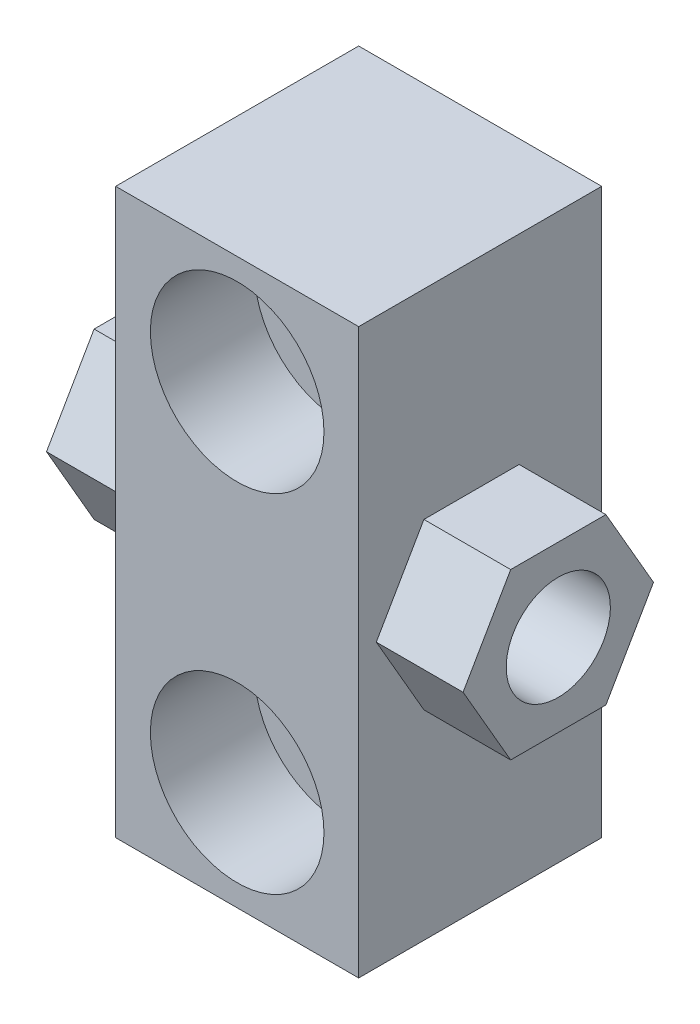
ISO-10303-21;
HEADER;
FILE_DESCRIPTION(('STEP AP214'),'2;1');
FILE_NAME('part.step','',(''),(''),'','','');
FILE_SCHEMA(('AUTOMOTIVE_DESIGN { 1 0 10303 214 1 1 1 1 }'));
ENDSEC;
DATA;
#1=APPLICATION_CONTEXT('core data for automotive mechanical design processes');
#2=APPLICATION_PROTOCOL_DEFINITION('international standard','automotive_design',2000,#1);
#3=PRODUCT_CONTEXT('',#1,'mechanical');
#4=PRODUCT('Part','Part','',(#3));
#5=PRODUCT_RELATED_PRODUCT_CATEGORY('part','',(#4));
#6=PRODUCT_DEFINITION_FORMATION('','',#4);
#7=PRODUCT_DEFINITION_CONTEXT('part definition',#1,'design');
#8=PRODUCT_DEFINITION('design','',#6,#7);
#9=PRODUCT_DEFINITION_SHAPE('','',#8);
#10=(LENGTH_UNIT() NAMED_UNIT(*) SI_UNIT(.MILLI.,.METRE.));
#11=(NAMED_UNIT(*) PLANE_ANGLE_UNIT() SI_UNIT($,.RADIAN.));
#12=(NAMED_UNIT(*) SI_UNIT($,.STERADIAN.) SOLID_ANGLE_UNIT());
#13=UNCERTAINTY_MEASURE_WITH_UNIT(LENGTH_MEASURE(1.E-05),#10,'distance_accuracy_value','');
#14=(GEOMETRIC_REPRESENTATION_CONTEXT(3) GLOBAL_UNCERTAINTY_ASSIGNED_CONTEXT((#13)) GLOBAL_UNIT_ASSIGNED_CONTEXT((#10,
#11,#12)) REPRESENTATION_CONTEXT('',''));
#15=CARTESIAN_POINT('',(0.,0.,0.));
#16=DIRECTION('',(0.,0.,1.));
#17=DIRECTION('',(1.,0.,0.));
#18=AXIS2_PLACEMENT_3D('',#15,#16,#17);
#19=CARTESIAN_POINT('',(0.,0.,29.));
#20=DIRECTION('',(0.,0.,1.));
#21=DIRECTION('',(1.,0.,0.));
#22=AXIS2_PLACEMENT_3D('',#19,#20,#21);
#23=CYLINDRICAL_SURFACE('',#22,6.5);
#24=CARTESIAN_POINT('',(0.,0.,0.));
#25=DIRECTION('',(0.,0.,-1.));
#26=DIRECTION('',(-1.,0.,0.));
#27=AXIS2_PLACEMENT_3D('',#24,#25,#26);
#28=CIRCLE('',#27,6.5);
#29=CARTESIAN_POINT('',(-6.5,0.,0.));
#30=VERTEX_POINT('',#29);
#31=EDGE_CURVE('E288',#30,#30,#28,.T.);
#32=ORIENTED_EDGE('',*,*,#31,.T.);
#33=EDGE_LOOP('',(#32));
#34=FACE_BOUND('',#33,.T.);
#35=CARTESIAN_POINT('',(0.,0.,16.));
#36=DIRECTION('',(0.,0.,1.));
#37=DIRECTION('',(1.,0.,0.));
#38=AXIS2_PLACEMENT_3D('',#35,#36,#37);
#39=CIRCLE('',#38,6.5);
#40=CARTESIAN_POINT('',(6.5,0.,16.));
#41=VERTEX_POINT('',#40);
#42=EDGE_CURVE('E18',#41,#41,#39,.T.);
#43=ORIENTED_EDGE('',*,*,#42,.T.);
#44=EDGE_LOOP('',(#43));
#45=FACE_BOUND('',#44,.T.);
#46=ADVANCED_FACE('F14',(#34,#45),#23,.F.);
#47=CARTESIAN_POINT('',(0.,40.,29.));
#48=DIRECTION('',(0.,0.,1.));
#49=DIRECTION('',(1.,0.,0.));
#50=AXIS2_PLACEMENT_3D('',#47,#48,#49);
#51=CYLINDRICAL_SURFACE('',#50,6.5);
#52=CARTESIAN_POINT('',(0.,40.,0.));
#53=DIRECTION('',(0.,0.,-1.));
#54=DIRECTION('',(-1.,0.,0.));
#55=AXIS2_PLACEMENT_3D('',#52,#53,#54);
#56=CIRCLE('',#55,6.5);
#57=CARTESIAN_POINT('',(-6.5,40.,0.));
#58=VERTEX_POINT('',#57);
#59=EDGE_CURVE('E285',#58,#58,#56,.T.);
#60=ORIENTED_EDGE('',*,*,#59,.T.);
#61=EDGE_LOOP('',(#60));
#62=FACE_BOUND('',#61,.T.);
#63=CARTESIAN_POINT('',(0.,40.,16.));
#64=DIRECTION('',(0.,0.,1.));
#65=DIRECTION('',(1.,0.,0.));
#66=AXIS2_PLACEMENT_3D('',#63,#64,#65);
#67=CIRCLE('',#66,6.5);
#68=CARTESIAN_POINT('',(6.5,40.,16.));
#69=VERTEX_POINT('',#68);
#70=EDGE_CURVE('E267',#69,#69,#67,.T.);
#71=ORIENTED_EDGE('',*,*,#70,.T.);
#72=EDGE_LOOP('',(#71));
#73=FACE_BOUND('',#72,.T.);
#74=ADVANCED_FACE('F310',(#62,#73),#51,.F.);
#75=CARTESIAN_POINT('',(-14.,-12.5,1.));
#76=DIRECTION('',(1.,0.,0.));
#77=DIRECTION('',(0.,1.,0.));
#78=AXIS2_PLACEMENT_3D('',#75,#76,#77);
#79=PLANE('',#78);
#80=DIRECTION('',(0.,0.866025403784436,0.5));
#81=VECTOR('',#80,1.);
#82=CARTESIAN_POINT('',(-14.,10.5,20.4848275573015));
#83=LINE('',#82,#81);
#84=CARTESIAN_POINT('',(-14.,10.5,20.4848275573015));
#85=VERTEX_POINT('',#84);
#86=CARTESIAN_POINT('',(-14.,20.,25.9696551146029));
#87=VERTEX_POINT('',#86);
#88=EDGE_CURVE('E39',#85,#87,#83,.T.);
#89=ORIENTED_EDGE('',*,*,#88,.F.);
#90=DIRECTION('',(0.,0.,-1.));
#91=VECTOR('',#90,1.);
#92=CARTESIAN_POINT('',(-14.,10.5,20.4848275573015));
#93=LINE('',#92,#91);
#94=CARTESIAN_POINT('',(-14.,10.5,9.5151724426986));
#95=VERTEX_POINT('',#94);
#96=EDGE_CURVE('E163',#85,#95,#93,.T.);
#97=ORIENTED_EDGE('',*,*,#96,.T.);
#98=DIRECTION('',(0.,0.866025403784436,-0.5));
#99=VECTOR('',#98,1.);
#100=CARTESIAN_POINT('',(-14.,10.5,9.5151724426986));
#101=LINE('',#100,#99);
#102=CARTESIAN_POINT('',(-14.,20.,4.0303448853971));
#103=VERTEX_POINT('',#102);
#104=EDGE_CURVE('E166',#95,#103,#101,.T.);
#105=ORIENTED_EDGE('',*,*,#104,.T.);
#106=DIRECTION('',(0.,-0.866025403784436,-0.5));
#107=VECTOR('',#106,1.);
#108=CARTESIAN_POINT('',(-14.,29.5,9.5151724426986));
#109=LINE('',#108,#107);
#110=CARTESIAN_POINT('',(-14.,29.5,9.5151724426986));
#111=VERTEX_POINT('',#110);
#112=EDGE_CURVE('E169',#111,#103,#109,.T.);
#113=ORIENTED_EDGE('',*,*,#112,.F.);
#114=DIRECTION('',(0.,0.,-1.));
#115=VECTOR('',#114,1.);
#116=CARTESIAN_POINT('',(-14.,29.5,20.4848275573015));
#117=LINE('',#116,#115);
#118=CARTESIAN_POINT('',(-14.,29.5,20.4848275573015));
#119=VERTEX_POINT('',#118);
#120=EDGE_CURVE('E172',#119,#111,#117,.T.);
#121=ORIENTED_EDGE('',*,*,#120,.F.);
#122=DIRECTION('',(0.,-0.866025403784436,0.5));
#123=VECTOR('',#122,1.);
#124=CARTESIAN_POINT('',(-14.,29.5,20.4848275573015));
#125=LINE('',#124,#123);
#126=EDGE_CURVE('E175',#119,#87,#125,.T.);
#127=ORIENTED_EDGE('',*,*,#126,.T.);
#128=EDGE_LOOP('',(#89,#97,#105,#113,#121,#127));
#129=FACE_BOUND('',#128,.T.);
#130=DIRECTION('',(0.,-1.,0.));
#131=VECTOR('',#130,1.);
#132=CARTESIAN_POINT('',(-14.,52.5,28.));
#133=LINE('',#132,#131);
#134=CARTESIAN_POINT('',(-14.,52.5,28.));
#135=VERTEX_POINT('',#134);
#136=CARTESIAN_POINT('',(-14.,-12.5,28.));
#137=VERTEX_POINT('',#136);
#138=EDGE_CURVE('E127',#135,#137,#133,.T.);
#139=ORIENTED_EDGE('',*,*,#138,.F.);
#140=DIRECTION('',(0.,0.,1.));
#141=VECTOR('',#140,1.);
#142=CARTESIAN_POINT('',(-14.,52.5,1.));
#143=LINE('',#142,#141);
#144=CARTESIAN_POINT('',(-14.,52.5,0.));
#145=VERTEX_POINT('',#144);
#146=EDGE_CURVE('E23',#145,#135,#143,.T.);
#147=ORIENTED_EDGE('',*,*,#146,.F.);
#148=DIRECTION('',(0.,1.,0.));
#149=VECTOR('',#148,1.);
#150=CARTESIAN_POINT('',(-14.,-12.5,0.));
#151=LINE('',#150,#149);
#152=CARTESIAN_POINT('',(-14.,-12.5,0.));
#153=VERTEX_POINT('',#152);
#154=EDGE_CURVE('E144',#153,#145,#151,.T.);
#155=ORIENTED_EDGE('',*,*,#154,.F.);
#156=DIRECTION('',(0.,0.,1.));
#157=VECTOR('',#156,1.);
#158=CARTESIAN_POINT('',(-14.,-12.5,1.));
#159=LINE('',#158,#157);
#160=EDGE_CURVE('E9',#153,#137,#159,.T.);
#161=ORIENTED_EDGE('',*,*,#160,.T.);
#162=EDGE_LOOP('',(#139,#147,#155,#161));
#163=FACE_BOUND('',#162,.T.);
#164=ADVANCED_FACE('F16',(#129,#163),#79,.F.);
#165=CARTESIAN_POINT('',(-14.,-12.5,1.));
#166=DIRECTION('',(0.,-1.,0.));
#167=DIRECTION('',(1.,0.,0.));
#168=AXIS2_PLACEMENT_3D('',#165,#166,#167);
#169=PLANE('',#168);
#170=DIRECTION('',(0.,0.,1.));
#171=VECTOR('',#170,1.);
#172=CARTESIAN_POINT('',(14.,-12.5,1.));
#173=LINE('',#172,#171);
#174=CARTESIAN_POINT('',(14.,-12.5,0.));
#175=VERTEX_POINT('',#174);
#176=CARTESIAN_POINT('',(14.,-12.5,28.));
#177=VERTEX_POINT('',#176);
#178=EDGE_CURVE('E139',#175,#177,#173,.T.);
#179=ORIENTED_EDGE('',*,*,#178,.T.);
#180=DIRECTION('',(1.,0.,0.));
#181=VECTOR('',#180,1.);
#182=CARTESIAN_POINT('',(-14.,-12.5,28.));
#183=LINE('',#182,#181);
#184=EDGE_CURVE('E31',#137,#177,#183,.T.);
#185=ORIENTED_EDGE('',*,*,#184,.F.);
#186=ORIENTED_EDGE('',*,*,#160,.F.);
#187=DIRECTION('',(-1.,0.,0.));
#188=VECTOR('',#187,1.);
#189=CARTESIAN_POINT('',(14.,-12.5,0.));
#190=LINE('',#189,#188);
#191=EDGE_CURVE('E149',#175,#153,#190,.T.);
#192=ORIENTED_EDGE('',*,*,#191,.F.);
#193=EDGE_LOOP('',(#179,#185,#186,#192));
#194=FACE_BOUND('',#193,.T.);
#195=ADVANCED_FACE('F136',(#194),#169,.T.);
#196=CARTESIAN_POINT('',(14.,52.5,1.));
#197=DIRECTION('',(0.,1.,0.));
#198=DIRECTION('',(-1.,0.,0.));
#199=AXIS2_PLACEMENT_3D('',#196,#197,#198);
#200=PLANE('',#199);
#201=ORIENTED_EDGE('',*,*,#146,.T.);
#202=DIRECTION('',(-1.,0.,0.));
#203=VECTOR('',#202,1.);
#204=CARTESIAN_POINT('',(14.,52.5,28.));
#205=LINE('',#204,#203);
#206=CARTESIAN_POINT('',(14.,52.5,28.));
#207=VERTEX_POINT('',#206);
#208=EDGE_CURVE('E130',#207,#135,#205,.T.);
#209=ORIENTED_EDGE('',*,*,#208,.F.);
#210=DIRECTION('',(0.,0.,1.));
#211=VECTOR('',#210,1.);
#212=CARTESIAN_POINT('',(14.,52.5,1.));
#213=LINE('',#212,#211);
#214=CARTESIAN_POINT('',(14.,52.5,0.));
#215=VERTEX_POINT('',#214);
#216=EDGE_CURVE('E260',#215,#207,#213,.T.);
#217=ORIENTED_EDGE('',*,*,#216,.F.);
#218=DIRECTION('',(1.,0.,0.));
#219=VECTOR('',#218,1.);
#220=CARTESIAN_POINT('',(-14.,52.5,0.));
#221=LINE('',#220,#219);
#222=EDGE_CURVE('E148',#145,#215,#221,.T.);
#223=ORIENTED_EDGE('',*,*,#222,.F.);
#224=EDGE_LOOP('',(#201,#209,#217,#223));
#225=FACE_BOUND('',#224,.T.);
#226=ADVANCED_FACE('F297',(#225),#200,.T.);
#227=CARTESIAN_POINT('',(14.,52.5,1.));
#228=DIRECTION('',(-1.,0.,0.));
#229=DIRECTION('',(0.,-1.,0.));
#230=AXIS2_PLACEMENT_3D('',#227,#228,#229);
#231=PLANE('',#230);
#232=DIRECTION('',(0.,0.,-1.));
#233=VECTOR('',#232,1.);
#234=CARTESIAN_POINT('',(14.,10.5,20.4848275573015));
#235=LINE('',#234,#233);
#236=CARTESIAN_POINT('',(14.,10.5,20.4848275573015));
#237=VERTEX_POINT('',#236);
#238=CARTESIAN_POINT('',(14.,10.5,9.5151724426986));
#239=VERTEX_POINT('',#238);
#240=EDGE_CURVE('E220',#237,#239,#235,.T.);
#241=ORIENTED_EDGE('',*,*,#240,.F.);
#242=DIRECTION('',(0.,0.866025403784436,0.5));
#243=VECTOR('',#242,1.);
#244=CARTESIAN_POINT('',(14.,10.5,20.4848275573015));
#245=LINE('',#244,#243);
#246=CARTESIAN_POINT('',(14.,20.,25.9696551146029));
#247=VERTEX_POINT('',#246);
#248=EDGE_CURVE('E208',#237,#247,#245,.T.);
#249=ORIENTED_EDGE('',*,*,#248,.T.);
#250=DIRECTION('',(0.,-0.866025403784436,0.5));
#251=VECTOR('',#250,1.);
#252=CARTESIAN_POINT('',(14.,29.5,20.4848275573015));
#253=LINE('',#252,#251);
#254=CARTESIAN_POINT('',(14.,29.5,20.4848275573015));
#255=VERTEX_POINT('',#254);
#256=EDGE_CURVE('E210',#255,#247,#253,.T.);
#257=ORIENTED_EDGE('',*,*,#256,.F.);
#258=DIRECTION('',(0.,0.,-1.));
#259=VECTOR('',#258,1.);
#260=CARTESIAN_POINT('',(14.,29.5,20.4848275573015));
#261=LINE('',#260,#259);
#262=CARTESIAN_POINT('',(14.,29.5,9.5151724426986));
#263=VERTEX_POINT('',#262);
#264=EDGE_CURVE('E213',#255,#263,#261,.T.);
#265=ORIENTED_EDGE('',*,*,#264,.T.);
#266=DIRECTION('',(0.,-0.866025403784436,-0.5));
#267=VECTOR('',#266,1.);
#268=CARTESIAN_POINT('',(14.,29.5,9.5151724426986));
#269=LINE('',#268,#267);
#270=CARTESIAN_POINT('',(14.,20.,4.0303448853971));
#271=VERTEX_POINT('',#270);
#272=EDGE_CURVE('E215',#263,#271,#269,.T.);
#273=ORIENTED_EDGE('',*,*,#272,.T.);
#274=DIRECTION('',(0.,0.866025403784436,-0.5));
#275=VECTOR('',#274,1.);
#276=CARTESIAN_POINT('',(14.,10.5,9.5151724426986));
#277=LINE('',#276,#275);
#278=EDGE_CURVE('E217',#239,#271,#277,.T.);
#279=ORIENTED_EDGE('',*,*,#278,.F.);
#280=EDGE_LOOP('',(#241,#249,#257,#265,#273,#279));
#281=FACE_BOUND('',#280,.T.);
#282=DIRECTION('',(0.,1.,0.));
#283=VECTOR('',#282,1.);
#284=CARTESIAN_POINT('',(14.,-12.5,28.));
#285=LINE('',#284,#283);
#286=EDGE_CURVE('E140',#177,#207,#285,.T.);
#287=ORIENTED_EDGE('',*,*,#286,.F.);
#288=ORIENTED_EDGE('',*,*,#178,.F.);
#289=DIRECTION('',(0.,-1.,0.));
#290=VECTOR('',#289,1.);
#291=CARTESIAN_POINT('',(14.,52.5,0.));
#292=LINE('',#291,#290);
#293=EDGE_CURVE('E153',#215,#175,#292,.T.);
#294=ORIENTED_EDGE('',*,*,#293,.F.);
#295=ORIENTED_EDGE('',*,*,#216,.T.);
#296=EDGE_LOOP('',(#287,#288,#294,#295));
#297=FACE_BOUND('',#296,.T.);
#298=ADVANCED_FACE('F295',(#281,#297),#231,.F.);
#299=CARTESIAN_POINT('',(0.,0.,29.));
#300=DIRECTION('',(0.,0.,1.));
#301=DIRECTION('',(1.,0.,0.));
#302=AXIS2_PLACEMENT_3D('',#299,#300,#301);
#303=CYLINDRICAL_SURFACE('',#302,10.);
#304=CARTESIAN_POINT('',(0.,0.,28.));
#305=DIRECTION('',(0.,0.,1.));
#306=DIRECTION('',(1.,0.,0.));
#307=AXIS2_PLACEMENT_3D('',#304,#305,#306);
#308=CIRCLE('',#307,10.);
#309=CARTESIAN_POINT('',(10.,0.,28.));
#310=VERTEX_POINT('',#309);
#311=EDGE_CURVE('E266',#310,#310,#308,.T.);
#312=ORIENTED_EDGE('',*,*,#311,.T.);
#313=EDGE_LOOP('',(#312));
#314=FACE_BOUND('',#313,.T.);
#315=CARTESIAN_POINT('',(0.,0.,16.));
#316=DIRECTION('',(0.,0.,1.));
#317=DIRECTION('',(1.,0.,0.));
#318=AXIS2_PLACEMENT_3D('',#315,#316,#317);
#319=CIRCLE('',#318,10.);
#320=CARTESIAN_POINT('',(10.,0.,16.));
#321=VERTEX_POINT('',#320);
#322=EDGE_CURVE('E274',#321,#321,#319,.T.);
#323=ORIENTED_EDGE('',*,*,#322,.F.);
#324=EDGE_LOOP('',(#323));
#325=FACE_BOUND('',#324,.T.);
#326=ADVANCED_FACE('F305',(#314,#325),#303,.F.);
#327=CARTESIAN_POINT('',(0.,40.,29.));
#328=DIRECTION('',(0.,0.,1.));
#329=DIRECTION('',(1.,0.,0.));
#330=AXIS2_PLACEMENT_3D('',#327,#328,#329);
#331=CYLINDRICAL_SURFACE('',#330,10.);
#332=CARTESIAN_POINT('',(0.,40.,28.));
#333=DIRECTION('',(0.,0.,1.));
#334=DIRECTION('',(1.,0.,0.));
#335=AXIS2_PLACEMENT_3D('',#332,#333,#334);
#336=CIRCLE('',#335,10.);
#337=CARTESIAN_POINT('',(10.,40.,28.));
#338=VERTEX_POINT('',#337);
#339=EDGE_CURVE('E264',#338,#338,#336,.T.);
#340=ORIENTED_EDGE('',*,*,#339,.T.);
#341=EDGE_LOOP('',(#340));
#342=FACE_BOUND('',#341,.T.);
#343=CARTESIAN_POINT('',(0.,40.,16.));
#344=DIRECTION('',(0.,0.,1.));
#345=DIRECTION('',(1.,0.,0.));
#346=AXIS2_PLACEMENT_3D('',#343,#344,#345);
#347=CIRCLE('',#346,10.);
#348=CARTESIAN_POINT('',(10.,40.,16.));
#349=VERTEX_POINT('',#348);
#350=EDGE_CURVE('E269',#349,#349,#347,.T.);
#351=ORIENTED_EDGE('',*,*,#350,.F.);
#352=EDGE_LOOP('',(#351));
#353=FACE_BOUND('',#352,.T.);
#354=ADVANCED_FACE('F322',(#342,#353),#331,.F.);
#355=CARTESIAN_POINT('',(24.,10.5,20.4848275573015));
#356=DIRECTION('',(0.,-0.5,0.866025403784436));
#357=DIRECTION('',(0.,-0.866025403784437,-0.5));
#358=AXIS2_PLACEMENT_3D('',#355,#356,#357);
#359=PLANE('',#358);
#360=DIRECTION('',(-1.,0.,0.));
#361=VECTOR('',#360,1.);
#362=CARTESIAN_POINT('',(24.,10.5,20.4848275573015));
#363=LINE('',#362,#361);
#364=CARTESIAN_POINT('',(24.,10.5,20.4848275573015));
#365=VERTEX_POINT('',#364);
#366=EDGE_CURVE('E256',#365,#237,#363,.T.);
#367=ORIENTED_EDGE('',*,*,#366,.F.);
#368=DIRECTION('',(0.,0.866025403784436,0.5));
#369=VECTOR('',#368,1.);
#370=CARTESIAN_POINT('',(24.,10.5,20.4848275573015));
#371=LINE('',#370,#369);
#372=CARTESIAN_POINT('',(24.,20.,25.9696551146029));
#373=VERTEX_POINT('',#372);
#374=EDGE_CURVE('E223',#365,#373,#371,.T.);
#375=ORIENTED_EDGE('',*,*,#374,.T.);
#376=DIRECTION('',(-1.,0.,0.));
#377=VECTOR('',#376,1.);
#378=CARTESIAN_POINT('',(24.,20.,25.9696551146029));
#379=LINE('',#378,#377);
#380=EDGE_CURVE('E241',#373,#247,#379,.T.);
#381=ORIENTED_EDGE('',*,*,#380,.T.);
#382=ORIENTED_EDGE('',*,*,#248,.F.);
#383=EDGE_LOOP('',(#367,#375,#381,#382));
#384=FACE_BOUND('',#383,.T.);
#385=ADVANCED_FACE('F329',(#384),#359,.T.);
#386=CARTESIAN_POINT('',(24.,10.5,20.4848275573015));
#387=DIRECTION('',(0.,1.,0.));
#388=DIRECTION('',(-1.,0.,0.));
#389=AXIS2_PLACEMENT_3D('',#386,#387,#388);
#390=PLANE('',#389);
#391=DIRECTION('',(-1.,0.,0.));
#392=VECTOR('',#391,1.);
#393=CARTESIAN_POINT('',(24.,10.5,9.5151724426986));
#394=LINE('',#393,#392);
#395=CARTESIAN_POINT('',(24.,10.5,9.5151724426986));
#396=VERTEX_POINT('',#395);
#397=EDGE_CURVE('E253',#396,#239,#394,.T.);
#398=ORIENTED_EDGE('',*,*,#397,.F.);
#399=DIRECTION('',(0.,0.,-1.));
#400=VECTOR('',#399,1.);
#401=CARTESIAN_POINT('',(24.,10.5,20.4848275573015));
#402=LINE('',#401,#400);
#403=EDGE_CURVE('E238',#365,#396,#402,.T.);
#404=ORIENTED_EDGE('',*,*,#403,.F.);
#405=ORIENTED_EDGE('',*,*,#366,.T.);
#406=ORIENTED_EDGE('',*,*,#240,.T.);
#407=EDGE_LOOP('',(#398,#404,#405,#406));
#408=FACE_BOUND('',#407,.T.);
#409=ADVANCED_FACE('F393',(#408),#390,.F.);
#410=CARTESIAN_POINT('',(24.,10.5,9.5151724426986));
#411=DIRECTION('',(0.,0.5,0.866025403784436));
#412=DIRECTION('',(0.,-0.866025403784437,0.5));
#413=AXIS2_PLACEMENT_3D('',#410,#411,#412);
#414=PLANE('',#413);
#415=DIRECTION('',(-1.,0.,0.));
#416=VECTOR('',#415,1.);
#417=CARTESIAN_POINT('',(24.,20.,4.0303448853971));
#418=LINE('',#417,#416);
#419=CARTESIAN_POINT('',(24.,20.,4.0303448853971));
#420=VERTEX_POINT('',#419);
#421=EDGE_CURVE('E250',#420,#271,#418,.T.);
#422=ORIENTED_EDGE('',*,*,#421,.F.);
#423=DIRECTION('',(0.,0.866025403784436,-0.5));
#424=VECTOR('',#423,1.);
#425=CARTESIAN_POINT('',(24.,10.5,9.5151724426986));
#426=LINE('',#425,#424);
#427=EDGE_CURVE('E235',#396,#420,#426,.T.);
#428=ORIENTED_EDGE('',*,*,#427,.F.);
#429=ORIENTED_EDGE('',*,*,#397,.T.);
#430=ORIENTED_EDGE('',*,*,#278,.T.);
#431=EDGE_LOOP('',(#422,#428,#429,#430));
#432=FACE_BOUND('',#431,.T.);
#433=ADVANCED_FACE('F404',(#432),#414,.F.);
#434=CARTESIAN_POINT('',(24.,29.5,9.5151724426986));
#435=DIRECTION('',(0.,0.5,-0.866025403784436));
#436=DIRECTION('',(0.,0.866025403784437,0.5));
#437=AXIS2_PLACEMENT_3D('',#434,#435,#436);
#438=PLANE('',#437);
#439=DIRECTION('',(-1.,0.,0.));
#440=VECTOR('',#439,1.);
#441=CARTESIAN_POINT('',(24.,29.5,9.5151724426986));
#442=LINE('',#441,#440);
#443=CARTESIAN_POINT('',(24.,29.5,9.5151724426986));
#444=VERTEX_POINT('',#443);
#445=EDGE_CURVE('E247',#444,#263,#442,.T.);
#446=ORIENTED_EDGE('',*,*,#445,.F.);
#447=DIRECTION('',(0.,-0.866025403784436,-0.5));
#448=VECTOR('',#447,1.);
#449=CARTESIAN_POINT('',(24.,29.5,9.5151724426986));
#450=LINE('',#449,#448);
#451=EDGE_CURVE('E232',#444,#420,#450,.T.);
#452=ORIENTED_EDGE('',*,*,#451,.T.);
#453=ORIENTED_EDGE('',*,*,#421,.T.);
#454=ORIENTED_EDGE('',*,*,#272,.F.);
#455=EDGE_LOOP('',(#446,#452,#453,#454));
#456=FACE_BOUND('',#455,.T.);
#457=ADVANCED_FACE('F400',(#456),#438,.T.);
#458=CARTESIAN_POINT('',(24.,29.5,20.4848275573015));
#459=DIRECTION('',(0.,1.,0.));
#460=DIRECTION('',(-1.,0.,0.));
#461=AXIS2_PLACEMENT_3D('',#458,#459,#460);
#462=PLANE('',#461);
#463=DIRECTION('',(-1.,0.,0.));
#464=VECTOR('',#463,1.);
#465=CARTESIAN_POINT('',(24.,29.5,20.4848275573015));
#466=LINE('',#465,#464);
#467=CARTESIAN_POINT('',(24.,29.5,20.4848275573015));
#468=VERTEX_POINT('',#467);
#469=EDGE_CURVE('E244',#468,#255,#466,.T.);
#470=ORIENTED_EDGE('',*,*,#469,.F.);
#471=DIRECTION('',(0.,0.,-1.));
#472=VECTOR('',#471,1.);
#473=CARTESIAN_POINT('',(24.,29.5,20.4848275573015));
#474=LINE('',#473,#472);
#475=EDGE_CURVE('E229',#468,#444,#474,.T.);
#476=ORIENTED_EDGE('',*,*,#475,.T.);
#477=ORIENTED_EDGE('',*,*,#445,.T.);
#478=ORIENTED_EDGE('',*,*,#264,.F.);
#479=EDGE_LOOP('',(#470,#476,#477,#478));
#480=FACE_BOUND('',#479,.T.);
#481=ADVANCED_FACE('F390',(#480),#462,.T.);
#482=CARTESIAN_POINT('',(24.,29.5,20.4848275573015));
#483=DIRECTION('',(0.,-0.5,-0.866025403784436));
#484=DIRECTION('',(0.,0.866025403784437,-0.5));
#485=AXIS2_PLACEMENT_3D('',#482,#483,#484);
#486=PLANE('',#485);
#487=DIRECTION('',(0.,-0.866025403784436,0.5));
#488=VECTOR('',#487,1.);
#489=CARTESIAN_POINT('',(24.,29.5,20.4848275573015));
#490=LINE('',#489,#488);
#491=EDGE_CURVE('E226',#468,#373,#490,.T.);
#492=ORIENTED_EDGE('',*,*,#491,.F.);
#493=ORIENTED_EDGE('',*,*,#469,.T.);
#494=ORIENTED_EDGE('',*,*,#256,.T.);
#495=ORIENTED_EDGE('',*,*,#380,.F.);
#496=EDGE_LOOP('',(#492,#493,#494,#495));
#497=FACE_BOUND('',#496,.T.);
#498=ADVANCED_FACE('F369',(#497),#486,.F.);
#499=CARTESIAN_POINT('',(24.,20.,25.9696551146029));
#500=DIRECTION('',(1.,0.,0.));
#501=DIRECTION('',(0.,1.,0.));
#502=AXIS2_PLACEMENT_3D('',#499,#500,#501);
#503=PLANE('',#502);
#504=CARTESIAN_POINT('',(24.,20.,15.));
#505=DIRECTION('',(1.,0.,0.));
#506=DIRECTION('',(0.,1.,0.));
#507=AXIS2_PLACEMENT_3D('',#504,#505,#506);
#508=CIRCLE('',#507,6.);
#509=CARTESIAN_POINT('',(24.,26.,15.));
#510=VERTEX_POINT('',#509);
#511=EDGE_CURVE('E151',#510,#510,#508,.T.);
#512=ORIENTED_EDGE('',*,*,#511,.F.);
#513=EDGE_LOOP('',(#512));
#514=FACE_BOUND('',#513,.T.);
#515=ORIENTED_EDGE('',*,*,#374,.F.);
#516=ORIENTED_EDGE('',*,*,#403,.T.);
#517=ORIENTED_EDGE('',*,*,#427,.T.);
#518=ORIENTED_EDGE('',*,*,#451,.F.);
#519=ORIENTED_EDGE('',*,*,#475,.F.);
#520=ORIENTED_EDGE('',*,*,#491,.T.);
#521=EDGE_LOOP('',(#515,#516,#517,#518,#519,#520));
#522=FACE_BOUND('',#521,.T.);
#523=ADVANCED_FACE('F368',(#514,#522),#503,.T.);
#524=CARTESIAN_POINT('',(-24.,10.5,20.4848275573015));
#525=DIRECTION('',(0.,0.5,-0.866025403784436));
#526=DIRECTION('',(0.,0.866025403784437,0.5));
#527=AXIS2_PLACEMENT_3D('',#524,#525,#526);
#528=PLANE('',#527);
#529=DIRECTION('',(1.,0.,0.));
#530=VECTOR('',#529,1.);
#531=CARTESIAN_POINT('',(-24.,20.,25.9696551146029));
#532=LINE('',#531,#530);
#533=CARTESIAN_POINT('',(-24.,20.,25.9696551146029));
#534=VERTEX_POINT('',#533);
#535=EDGE_CURVE('E206',#534,#87,#532,.T.);
#536=ORIENTED_EDGE('',*,*,#535,.F.);
#537=DIRECTION('',(0.,0.866025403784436,0.5));
#538=VECTOR('',#537,1.);
#539=CARTESIAN_POINT('',(-24.,10.5,20.4848275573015));
#540=LINE('',#539,#538);
#541=CARTESIAN_POINT('',(-24.,10.5,20.4848275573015));
#542=VERTEX_POINT('',#541);
#543=EDGE_CURVE('E178',#542,#534,#540,.T.);
#544=ORIENTED_EDGE('',*,*,#543,.F.);
#545=DIRECTION('',(1.,0.,0.));
#546=VECTOR('',#545,1.);
#547=CARTESIAN_POINT('',(-24.,10.5,20.4848275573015));
#548=LINE('',#547,#546);
#549=EDGE_CURVE('E196',#542,#85,#548,.T.);
#550=ORIENTED_EDGE('',*,*,#549,.T.);
#551=ORIENTED_EDGE('',*,*,#88,.T.);
#552=EDGE_LOOP('',(#536,#544,#550,#551));
#553=FACE_BOUND('',#552,.T.);
#554=ADVANCED_FACE('F364',(#553),#528,.F.);
#555=CARTESIAN_POINT('',(-24.,29.5,20.4848275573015));
#556=DIRECTION('',(0.,0.5,0.866025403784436));
#557=DIRECTION('',(0.,-0.866025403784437,0.5));
#558=AXIS2_PLACEMENT_3D('',#555,#556,#557);
#559=PLANE('',#558);
#560=DIRECTION('',(1.,0.,0.));
#561=VECTOR('',#560,1.);
#562=CARTESIAN_POINT('',(-24.,29.5,20.4848275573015));
#563=LINE('',#562,#561);
#564=CARTESIAN_POINT('',(-24.,29.5,20.4848275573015));
#565=VERTEX_POINT('',#564);
#566=EDGE_CURVE('E204',#565,#119,#563,.T.);
#567=ORIENTED_EDGE('',*,*,#566,.F.);
#568=DIRECTION('',(0.,-0.866025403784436,0.5));
#569=VECTOR('',#568,1.);
#570=CARTESIAN_POINT('',(-24.,29.5,20.4848275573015));
#571=LINE('',#570,#569);
#572=EDGE_CURVE('E193',#565,#534,#571,.T.);
#573=ORIENTED_EDGE('',*,*,#572,.T.);
#574=ORIENTED_EDGE('',*,*,#535,.T.);
#575=ORIENTED_EDGE('',*,*,#126,.F.);
#576=EDGE_LOOP('',(#567,#573,#574,#575));
#577=FACE_BOUND('',#576,.T.);
#578=ADVANCED_FACE('F367',(#577),#559,.T.);
#579=CARTESIAN_POINT('',(-24.,29.5,20.4848275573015));
#580=DIRECTION('',(0.,-1.,0.));
#581=DIRECTION('',(1.,0.,0.));
#582=AXIS2_PLACEMENT_3D('',#579,#580,#581);
#583=PLANE('',#582);
#584=DIRECTION('',(1.,0.,0.));
#585=VECTOR('',#584,1.);
#586=CARTESIAN_POINT('',(-24.,29.5,9.5151724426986));
#587=LINE('',#586,#585);
#588=CARTESIAN_POINT('',(-24.,29.5,9.5151724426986));
#589=VERTEX_POINT('',#588);
#590=EDGE_CURVE('E202',#589,#111,#587,.T.);
#591=ORIENTED_EDGE('',*,*,#590,.F.);
#592=DIRECTION('',(0.,0.,-1.));
#593=VECTOR('',#592,1.);
#594=CARTESIAN_POINT('',(-24.,29.5,20.4848275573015));
#595=LINE('',#594,#593);
#596=EDGE_CURVE('E190',#565,#589,#595,.T.);
#597=ORIENTED_EDGE('',*,*,#596,.F.);
#598=ORIENTED_EDGE('',*,*,#566,.T.);
#599=ORIENTED_EDGE('',*,*,#120,.T.);
#600=EDGE_LOOP('',(#591,#597,#598,#599));
#601=FACE_BOUND('',#600,.T.);
#602=ADVANCED_FACE('F379',(#601),#583,.F.);
#603=CARTESIAN_POINT('',(-24.,29.5,9.5151724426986));
#604=DIRECTION('',(0.,-0.5,0.866025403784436));
#605=DIRECTION('',(0.,-0.866025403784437,-0.5));
#606=AXIS2_PLACEMENT_3D('',#603,#604,#605);
#607=PLANE('',#606);
#608=DIRECTION('',(1.,0.,0.));
#609=VECTOR('',#608,1.);
#610=CARTESIAN_POINT('',(-24.,20.,4.0303448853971));
#611=LINE('',#610,#609);
#612=CARTESIAN_POINT('',(-24.,20.,4.0303448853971));
#613=VERTEX_POINT('',#612);
#614=EDGE_CURVE('E200',#613,#103,#611,.T.);
#615=ORIENTED_EDGE('',*,*,#614,.F.);
#616=DIRECTION('',(0.,-0.866025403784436,-0.5));
#617=VECTOR('',#616,1.);
#618=CARTESIAN_POINT('',(-24.,29.5,9.5151724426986));
#619=LINE('',#618,#617);
#620=EDGE_CURVE('E187',#589,#613,#619,.T.);
#621=ORIENTED_EDGE('',*,*,#620,.F.);
#622=ORIENTED_EDGE('',*,*,#590,.T.);
#623=ORIENTED_EDGE('',*,*,#112,.T.);
#624=EDGE_LOOP('',(#615,#621,#622,#623));
#625=FACE_BOUND('',#624,.T.);
#626=ADVANCED_FACE('F375',(#625),#607,.F.);
#627=CARTESIAN_POINT('',(-24.,10.5,9.5151724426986));
#628=DIRECTION('',(0.,-0.5,-0.866025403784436));
#629=DIRECTION('',(0.,0.866025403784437,-0.5));
#630=AXIS2_PLACEMENT_3D('',#627,#628,#629);
#631=PLANE('',#630);
#632=DIRECTION('',(1.,0.,0.));
#633=VECTOR('',#632,1.);
#634=CARTESIAN_POINT('',(-24.,10.5,9.5151724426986));
#635=LINE('',#634,#633);
#636=CARTESIAN_POINT('',(-24.,10.5,9.5151724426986));
#637=VERTEX_POINT('',#636);
#638=EDGE_CURVE('E198',#637,#95,#635,.T.);
#639=ORIENTED_EDGE('',*,*,#638,.F.);
#640=DIRECTION('',(0.,0.866025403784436,-0.5));
#641=VECTOR('',#640,1.);
#642=CARTESIAN_POINT('',(-24.,10.5,9.5151724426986));
#643=LINE('',#642,#641);
#644=EDGE_CURVE('E184',#637,#613,#643,.T.);
#645=ORIENTED_EDGE('',*,*,#644,.T.);
#646=ORIENTED_EDGE('',*,*,#614,.T.);
#647=ORIENTED_EDGE('',*,*,#104,.F.);
#648=EDGE_LOOP('',(#639,#645,#646,#647));
#649=FACE_BOUND('',#648,.T.);
#650=ADVANCED_FACE('F363',(#649),#631,.T.);
#651=CARTESIAN_POINT('',(-24.,10.5,20.4848275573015));
#652=DIRECTION('',(0.,-1.,0.));
#653=DIRECTION('',(1.,0.,0.));
#654=AXIS2_PLACEMENT_3D('',#651,#652,#653);
#655=PLANE('',#654);
#656=DIRECTION('',(0.,0.,-1.));
#657=VECTOR('',#656,1.);
#658=CARTESIAN_POINT('',(-24.,10.5,20.4848275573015));
#659=LINE('',#658,#657);
#660=EDGE_CURVE('E181',#542,#637,#659,.T.);
#661=ORIENTED_EDGE('',*,*,#660,.T.);
#662=ORIENTED_EDGE('',*,*,#638,.T.);
#663=ORIENTED_EDGE('',*,*,#96,.F.);
#664=ORIENTED_EDGE('',*,*,#549,.F.);
#665=EDGE_LOOP('',(#661,#662,#663,#664));
#666=FACE_BOUND('',#665,.T.);
#667=ADVANCED_FACE('F359',(#666),#655,.T.);
#668=CARTESIAN_POINT('',(-24.,20.,25.9696551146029));
#669=DIRECTION('',(-1.,0.,0.));
#670=DIRECTION('',(0.,1.,0.));
#671=AXIS2_PLACEMENT_3D('',#668,#669,#670);
#672=PLANE('',#671);
#673=CARTESIAN_POINT('',(-24.,20.,15.));
#674=DIRECTION('',(1.,0.,0.));
#675=DIRECTION('',(0.,1.,0.));
#676=AXIS2_PLACEMENT_3D('',#673,#674,#675);
#677=CIRCLE('',#676,6.);
#678=CARTESIAN_POINT('',(-24.,26.,15.));
#679=VERTEX_POINT('',#678);
#680=EDGE_CURVE('E159',#679,#679,#677,.T.);
#681=ORIENTED_EDGE('',*,*,#680,.T.);
#682=EDGE_LOOP('',(#681));
#683=FACE_BOUND('',#682,.T.);
#684=ORIENTED_EDGE('',*,*,#543,.T.);
#685=ORIENTED_EDGE('',*,*,#572,.F.);
#686=ORIENTED_EDGE('',*,*,#596,.T.);
#687=ORIENTED_EDGE('',*,*,#620,.T.);
#688=ORIENTED_EDGE('',*,*,#644,.F.);
#689=ORIENTED_EDGE('',*,*,#660,.F.);
#690=EDGE_LOOP('',(#684,#685,#686,#687,#688,#689));
#691=FACE_BOUND('',#690,.T.);
#692=ADVANCED_FACE('F357',(#683,#691),#672,.T.);
#693=CARTESIAN_POINT('',(-24.,20.,15.));
#694=DIRECTION('',(1.,0.,0.));
#695=DIRECTION('',(0.,1.,0.));
#696=AXIS2_PLACEMENT_3D('',#693,#694,#695);
#697=CYLINDRICAL_SURFACE('',#696,6.);
#698=ORIENTED_EDGE('',*,*,#680,.F.);
#699=EDGE_LOOP('',(#698));
#700=FACE_BOUND('',#699,.T.);
#701=ORIENTED_EDGE('',*,*,#511,.T.);
#702=EDGE_LOOP('',(#701));
#703=FACE_BOUND('',#702,.T.);
#704=ADVANCED_FACE('F353',(#700,#703),#697,.F.);
#705=CARTESIAN_POINT('',(0.,20.,0.));
#706=DIRECTION('',(0.,0.,-1.));
#707=DIRECTION('',(-1.,0.,0.));
#708=AXIS2_PLACEMENT_3D('',#705,#706,#707);
#709=PLANE('',#708);
#710=ORIENTED_EDGE('',*,*,#31,.F.);
#711=EDGE_LOOP('',(#710));
#712=FACE_BOUND('',#711,.T.);
#713=ORIENTED_EDGE('',*,*,#293,.T.);
#714=ORIENTED_EDGE('',*,*,#191,.T.);
#715=ORIENTED_EDGE('',*,*,#154,.T.);
#716=ORIENTED_EDGE('',*,*,#222,.T.);
#717=EDGE_LOOP('',(#713,#714,#715,#716));
#718=FACE_BOUND('',#717,.T.);
#719=ORIENTED_EDGE('',*,*,#59,.F.);
#720=EDGE_LOOP('',(#719));
#721=FACE_BOUND('',#720,.T.);
#722=ADVANCED_FACE('F292',(#712,#718,#721),#709,.T.);
#723=CARTESIAN_POINT('',(0.,20.,28.));
#724=DIRECTION('',(0.,0.,1.));
#725=DIRECTION('',(1.,0.,0.));
#726=AXIS2_PLACEMENT_3D('',#723,#724,#725);
#727=PLANE('',#726);
#728=ORIENTED_EDGE('',*,*,#311,.F.);
#729=EDGE_LOOP('',(#728));
#730=FACE_BOUND('',#729,.T.);
#731=ORIENTED_EDGE('',*,*,#339,.F.);
#732=EDGE_LOOP('',(#731));
#733=FACE_BOUND('',#732,.T.);
#734=ORIENTED_EDGE('',*,*,#138,.T.);
#735=ORIENTED_EDGE('',*,*,#184,.T.);
#736=ORIENTED_EDGE('',*,*,#286,.T.);
#737=ORIENTED_EDGE('',*,*,#208,.T.);
#738=EDGE_LOOP('',(#734,#735,#736,#737));
#739=FACE_BOUND('',#738,.T.);
#740=ADVANCED_FACE('F128',(#730,#733,#739),#727,.T.);
#741=CARTESIAN_POINT('',(0.,40.,16.));
#742=DIRECTION('',(0.,0.,1.));
#743=DIRECTION('',(1.,0.,0.));
#744=AXIS2_PLACEMENT_3D('',#741,#742,#743);
#745=PLANE('',#744);
#746=ORIENTED_EDGE('',*,*,#70,.F.);
#747=EDGE_LOOP('',(#746));
#748=FACE_BOUND('',#747,.T.);
#749=ORIENTED_EDGE('',*,*,#350,.T.);
#750=EDGE_LOOP('',(#749));
#751=FACE_BOUND('',#750,.T.);
#752=ADVANCED_FACE('F337',(#748,#751),#745,.T.);
#753=CARTESIAN_POINT('',(0.,0.,16.));
#754=DIRECTION('',(0.,0.,1.));
#755=DIRECTION('',(1.,0.,0.));
#756=AXIS2_PLACEMENT_3D('',#753,#754,#755);
#757=PLANE('',#756);
#758=ORIENTED_EDGE('',*,*,#42,.F.);
#759=EDGE_LOOP('',(#758));
#760=FACE_BOUND('',#759,.T.);
#761=ORIENTED_EDGE('',*,*,#322,.T.);
#762=EDGE_LOOP('',(#761));
#763=FACE_BOUND('',#762,.T.);
#764=ADVANCED_FACE('F335',(#760,#763),#757,.T.);
#765=CLOSED_SHELL('',(#46,#74,#164,#195,#226,#298,#326,#354,#385,#409,#433,#457,#481,#498,#523,
#554,#578,#602,#626,#650,#667,#692,#704,#722,#740,#752,#764));
#766=MANIFOLD_SOLID_BREP('B1',#765);
#767=ADVANCED_BREP_SHAPE_REPRESENTATION('',(#18,#766),#14);
#768=SHAPE_DEFINITION_REPRESENTATION(#9,#767);
ENDSEC;
END-ISO-10303-21;
